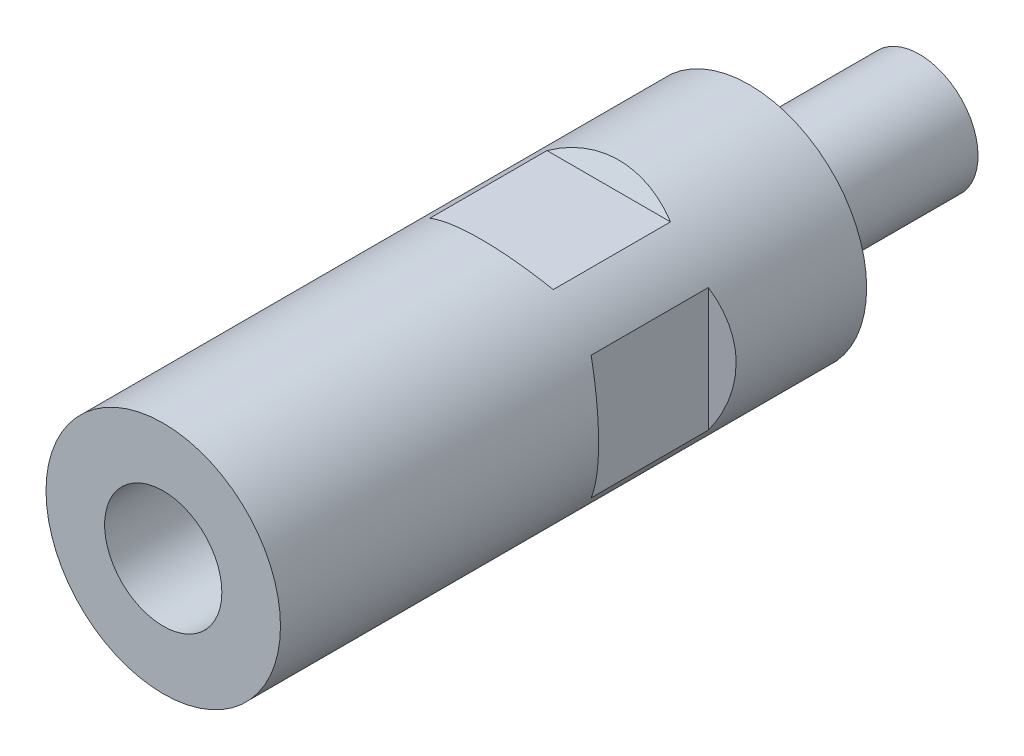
ISO-10303-21;
HEADER;
FILE_DESCRIPTION(('STEP AP214'),'2;1');
FILE_NAME('part.step','',(''),(''),'','','');
FILE_SCHEMA(('AUTOMOTIVE_DESIGN { 1 0 10303 214 1 1 1 1 }'));
ENDSEC;
DATA;
#1=APPLICATION_CONTEXT('core data for automotive mechanical design processes');
#2=APPLICATION_PROTOCOL_DEFINITION('international standard','automotive_design',2000,#1);
#3=PRODUCT_CONTEXT('',#1,'mechanical');
#4=PRODUCT('Part','Part','',(#3));
#5=PRODUCT_RELATED_PRODUCT_CATEGORY('part','',(#4));
#6=PRODUCT_DEFINITION_FORMATION('','',#4);
#7=PRODUCT_DEFINITION_CONTEXT('part definition',#1,'design');
#8=PRODUCT_DEFINITION('design','',#6,#7);
#9=PRODUCT_DEFINITION_SHAPE('','',#8);
#10=(LENGTH_UNIT() NAMED_UNIT(*) SI_UNIT(.MILLI.,.METRE.));
#11=(NAMED_UNIT(*) PLANE_ANGLE_UNIT() SI_UNIT($,.RADIAN.));
#12=(NAMED_UNIT(*) SI_UNIT($,.STERADIAN.) SOLID_ANGLE_UNIT());
#13=UNCERTAINTY_MEASURE_WITH_UNIT(LENGTH_MEASURE(1.E-05),#10,'distance_accuracy_value','');
#14=(GEOMETRIC_REPRESENTATION_CONTEXT(3) GLOBAL_UNCERTAINTY_ASSIGNED_CONTEXT((#13)) GLOBAL_UNIT_ASSIGNED_CONTEXT((#10,
#11,#12)) REPRESENTATION_CONTEXT('',''));
#15=CARTESIAN_POINT('',(0.,0.,0.));
#16=DIRECTION('',(0.,0.,1.));
#17=DIRECTION('',(1.,0.,0.));
#18=AXIS2_PLACEMENT_3D('',#15,#16,#17);
#19=CARTESIAN_POINT('',(0.,0.,-14.5));
#20=DIRECTION('',(0.,0.,1.));
#21=DIRECTION('',(0.,-1.,0.));
#22=AXIS2_PLACEMENT_3D('',#19,#20,#21);
#23=PLANE('',#22);
#24=CARTESIAN_POINT('',(0.,0.,-14.5));
#25=DIRECTION('',(0.,0.,1.));
#26=DIRECTION('',(0.,-1.,0.));
#27=AXIS2_PLACEMENT_3D('',#24,#25,#26);
#28=CIRCLE('',#27,5.);
#29=CARTESIAN_POINT('',(0.,-5.,-14.5));
#30=VERTEX_POINT('',#29);
#31=EDGE_CURVE('E21',#30,#30,#28,.F.);
#32=ORIENTED_EDGE('',*,*,#31,.T.);
#33=EDGE_LOOP('',(#32));
#34=FACE_BOUND('',#33,.T.);
#35=ADVANCED_FACE('F14',(#34),#23,.F.);
#36=CARTESIAN_POINT('',(0.,0.,5.5));
#37=DIRECTION('',(0.,0.,1.));
#38=DIRECTION('',(0.,-1.,0.));
#39=AXIS2_PLACEMENT_3D('',#36,#37,#38);
#40=CYLINDRICAL_SURFACE('',#39,5.);
#41=ORIENTED_EDGE('',*,*,#31,.F.);
#42=EDGE_LOOP('',(#41));
#43=FACE_BOUND('',#42,.T.);
#44=CARTESIAN_POINT('',(0.,0.,0.));
#45=DIRECTION('',(0.,0.,1.));
#46=DIRECTION('',(1.,0.,0.));
#47=AXIS2_PLACEMENT_3D('',#44,#45,#46);
#48=CIRCLE('',#47,5.);
#49=CARTESIAN_POINT('',(5.,0.,0.));
#50=VERTEX_POINT('',#49);
#51=EDGE_CURVE('E9',#50,#50,#48,.T.);
#52=ORIENTED_EDGE('',*,*,#51,.F.);
#53=EDGE_LOOP('',(#52));
#54=FACE_BOUND('',#53,.T.);
#55=ADVANCED_FACE('F108',(#43,#54),#40,.T.);
#56=CARTESIAN_POINT('',(0.,0.,50.));
#57=DIRECTION('',(0.,0.,1.));
#58=DIRECTION('',(1.,0.,0.));
#59=AXIS2_PLACEMENT_3D('',#56,#57,#58);
#60=PLANE('',#59);
#61=CARTESIAN_POINT('',(0.,4.36432032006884E-13,50.));
#62=DIRECTION('',(0.,0.,1.));
#63=DIRECTION('',(1.,0.,0.));
#64=AXIS2_PLACEMENT_3D('',#61,#62,#63);
#65=CIRCLE('',#64,5.);
#66=CARTESIAN_POINT('',(5.,4.36432032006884E-13,50.));
#67=VERTEX_POINT('',#66);
#68=EDGE_CURVE('E141',#67,#67,#65,.T.);
#69=ORIENTED_EDGE('',*,*,#68,.F.);
#70=EDGE_LOOP('',(#69));
#71=FACE_BOUND('',#70,.T.);
#72=CARTESIAN_POINT('',(0.,0.,50.));
#73=DIRECTION('',(0.,0.,1.));
#74=DIRECTION('',(1.,0.,0.));
#75=AXIS2_PLACEMENT_3D('',#72,#73,#74);
#76=CIRCLE('',#75,10.);
#77=CARTESIAN_POINT('',(10.,0.,50.));
#78=VERTEX_POINT('',#77);
#79=EDGE_CURVE('E144',#78,#78,#76,.T.);
#80=ORIENTED_EDGE('',*,*,#79,.T.);
#81=EDGE_LOOP('',(#80));
#82=FACE_BOUND('',#81,.T.);
#83=ADVANCED_FACE('F111',(#71,#82),#60,.T.);
#84=CARTESIAN_POINT('',(8.5,-10.,22.));
#85=DIRECTION('',(-0.5,0.,0.866025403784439));
#86=DIRECTION('',(0.866025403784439,0.,0.5));
#87=AXIS2_PLACEMENT_3D('',#84,#85,#86);
#88=PLANE('',#87);
#89=DIRECTION('',(0.,1.,0.));
#90=VECTOR('',#89,1.);
#91=CARTESIAN_POINT('',(8.5,-10.,22.));
#92=LINE('',#91,#90);
#93=CARTESIAN_POINT('',(8.5,-5.26782687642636,22.));
#94=VERTEX_POINT('',#93);
#95=CARTESIAN_POINT('',(8.5,5.26782687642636,22.));
#96=VERTEX_POINT('',#95);
#97=EDGE_CURVE('E151',#94,#96,#92,.T.);
#98=ORIENTED_EDGE('',*,*,#97,.T.);
#99=CARTESIAN_POINT('',(0.,0.,17.0925227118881));
#100=DIRECTION('',(-0.5,0.,0.866025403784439));
#101=DIRECTION('',(-0.866025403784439,0.,-0.5));
#102=AXIS2_PLACEMENT_3D('',#99,#100,#101);
#103=ELLIPSE('',#102,11.5470053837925,10.);
#104=EDGE_CURVE('E34',#94,#96,#103,.T.);
#105=ORIENTED_EDGE('',*,*,#104,.F.);
#106=EDGE_LOOP('',(#98,#105));
#107=FACE_BOUND('',#106,.T.);
#108=ADVANCED_FACE('F132',(#107),#88,.F.);
#109=CARTESIAN_POINT('',(8.5,-10.,22.));
#110=DIRECTION('',(-1.,0.,0.));
#111=DIRECTION('',(0.,0.,1.));
#112=AXIS2_PLACEMENT_3D('',#109,#110,#111);
#113=PLANE('',#112);
#114=ORIENTED_EDGE('',*,*,#97,.F.);
#115=DIRECTION('',(0.,0.,-1.));
#116=VECTOR('',#115,1.);
#117=CARTESIAN_POINT('',(8.5,-5.26782687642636,50.));
#118=LINE('',#117,#116);
#119=CARTESIAN_POINT('',(8.5,-5.26782687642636,12.));
#120=VERTEX_POINT('',#119);
#121=EDGE_CURVE('E157',#120,#94,#118,.F.);
#122=ORIENTED_EDGE('',*,*,#121,.F.);
#123=DIRECTION('',(0.,1.,0.));
#124=VECTOR('',#123,1.);
#125=CARTESIAN_POINT('',(8.5,-10.,12.));
#126=LINE('',#125,#124);
#127=CARTESIAN_POINT('',(8.5,5.26782687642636,12.));
#128=VERTEX_POINT('',#127);
#129=EDGE_CURVE('E200',#120,#128,#126,.T.);
#130=ORIENTED_EDGE('',*,*,#129,.T.);
#131=DIRECTION('',(0.,0.,-1.));
#132=VECTOR('',#131,1.);
#133=CARTESIAN_POINT('',(8.5,5.26782687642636,50.));
#134=LINE('',#133,#132);
#135=EDGE_CURVE('E28',#96,#128,#134,.T.);
#136=ORIENTED_EDGE('',*,*,#135,.F.);
#137=EDGE_LOOP('',(#114,#122,#130,#136));
#138=FACE_BOUND('',#137,.T.);
#139=ADVANCED_FACE('F137',(#138),#113,.F.);
#140=CARTESIAN_POINT('',(8.5,-10.,12.));
#141=DIRECTION('',(-0.5,0.,-0.866025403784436));
#142=DIRECTION('',(-0.866025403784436,0.,0.5));
#143=AXIS2_PLACEMENT_3D('',#140,#141,#142);
#144=PLANE('',#143);
#145=CARTESIAN_POINT('',(0.,0.,16.9074772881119));
#146=DIRECTION('',(-0.5,0.,-0.866025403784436));
#147=DIRECTION('',(0.866025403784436,0.,-0.5));
#148=AXIS2_PLACEMENT_3D('',#145,#146,#147);
#149=ELLIPSE('',#148,11.5470053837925,10.);
#150=EDGE_CURVE('E146',#128,#120,#149,.T.);
#151=ORIENTED_EDGE('',*,*,#150,.F.);
#152=ORIENTED_EDGE('',*,*,#129,.F.);
#153=EDGE_LOOP('',(#151,#152));
#154=FACE_BOUND('',#153,.T.);
#155=ADVANCED_FACE('F207',(#154),#144,.F.);
#156=CARTESIAN_POINT('',(-8.5,-10.,12.));
#157=DIRECTION('',(0.5,0.,-0.866025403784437));
#158=DIRECTION('',(-0.866025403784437,0.,-0.5));
#159=AXIS2_PLACEMENT_3D('',#156,#157,#158);
#160=PLANE('',#159);
#161=CARTESIAN_POINT('',(0.,0.,16.9074772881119));
#162=DIRECTION('',(0.5,0.,-0.866025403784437));
#163=DIRECTION('',(-0.866025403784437,0.,-0.5));
#164=AXIS2_PLACEMENT_3D('',#161,#162,#163);
#165=ELLIPSE('',#164,11.5470053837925,10.);
#166=CARTESIAN_POINT('',(-8.5,-5.26782687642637,12.));
#167=VERTEX_POINT('',#166);
#168=CARTESIAN_POINT('',(-8.5,5.26782687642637,12.));
#169=VERTEX_POINT('',#168);
#170=EDGE_CURVE('E160',#167,#169,#165,.T.);
#171=ORIENTED_EDGE('',*,*,#170,.F.);
#172=DIRECTION('',(0.,1.,0.));
#173=VECTOR('',#172,1.);
#174=CARTESIAN_POINT('',(-8.5,-10.,12.));
#175=LINE('',#174,#173);
#176=EDGE_CURVE('E193',#167,#169,#175,.T.);
#177=ORIENTED_EDGE('',*,*,#176,.T.);
#178=EDGE_LOOP('',(#171,#177));
#179=FACE_BOUND('',#178,.T.);
#180=ADVANCED_FACE('F209',(#179),#160,.F.);
#181=CARTESIAN_POINT('',(-8.5,-10.,22.));
#182=DIRECTION('',(0.5,0.,0.866025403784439));
#183=DIRECTION('',(0.866025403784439,0.,-0.5));
#184=AXIS2_PLACEMENT_3D('',#181,#182,#183);
#185=PLANE('',#184);
#186=DIRECTION('',(0.,1.,0.));
#187=VECTOR('',#186,1.);
#188=CARTESIAN_POINT('',(-8.5,-10.,22.));
#189=LINE('',#188,#187);
#190=CARTESIAN_POINT('',(-8.5,-5.26782687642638,22.));
#191=VERTEX_POINT('',#190);
#192=CARTESIAN_POINT('',(-8.5,5.26782687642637,22.));
#193=VERTEX_POINT('',#192);
#194=EDGE_CURVE('E197',#191,#193,#189,.T.);
#195=ORIENTED_EDGE('',*,*,#194,.F.);
#196=CARTESIAN_POINT('',(0.,0.,17.0925227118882));
#197=DIRECTION('',(0.5,0.,0.866025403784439));
#198=DIRECTION('',(0.866025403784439,0.,-0.5));
#199=AXIS2_PLACEMENT_3D('',#196,#197,#198);
#200=ELLIPSE('',#199,11.5470053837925,10.);
#201=EDGE_CURVE('E168',#193,#191,#200,.T.);
#202=ORIENTED_EDGE('',*,*,#201,.F.);
#203=EDGE_LOOP('',(#195,#202));
#204=FACE_BOUND('',#203,.T.);
#205=ADVANCED_FACE('F215',(#204),#185,.F.);
#206=CARTESIAN_POINT('',(-8.5,-10.,22.));
#207=DIRECTION('',(1.,0.,0.));
#208=DIRECTION('',(0.,0.,-1.));
#209=AXIS2_PLACEMENT_3D('',#206,#207,#208);
#210=PLANE('',#209);
#211=ORIENTED_EDGE('',*,*,#194,.T.);
#212=DIRECTION('',(0.,0.,-1.));
#213=VECTOR('',#212,1.);
#214=CARTESIAN_POINT('',(-8.5,5.26782687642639,50.));
#215=LINE('',#214,#213);
#216=EDGE_CURVE('E162',#169,#193,#215,.F.);
#217=ORIENTED_EDGE('',*,*,#216,.F.);
#218=ORIENTED_EDGE('',*,*,#176,.F.);
#219=DIRECTION('',(0.,0.,-1.));
#220=VECTOR('',#219,1.);
#221=CARTESIAN_POINT('',(-8.5,-5.26782687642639,50.));
#222=LINE('',#221,#220);
#223=EDGE_CURVE('E165',#191,#167,#222,.T.);
#224=ORIENTED_EDGE('',*,*,#223,.F.);
#225=EDGE_LOOP('',(#211,#217,#218,#224));
#226=FACE_BOUND('',#225,.T.);
#227=ADVANCED_FACE('F220',(#226),#210,.F.);
#228=CARTESIAN_POINT('',(10.,8.5,22.));
#229=DIRECTION('',(0.,-0.5,0.866025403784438));
#230=DIRECTION('',(0.,-0.866025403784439,-0.5));
#231=AXIS2_PLACEMENT_3D('',#228,#229,#230);
#232=PLANE('',#231);
#233=DIRECTION('',(-1.,0.,0.));
#234=VECTOR('',#233,1.);
#235=CARTESIAN_POINT('',(10.,8.5,22.));
#236=LINE('',#235,#234);
#237=CARTESIAN_POINT('',(5.26782687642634,8.5,22.));
#238=VERTEX_POINT('',#237);
#239=CARTESIAN_POINT('',(-5.26782687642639,8.5,22.));
#240=VERTEX_POINT('',#239);
#241=EDGE_CURVE('E189',#238,#240,#236,.T.);
#242=ORIENTED_EDGE('',*,*,#241,.T.);
#243=CARTESIAN_POINT('',(0.,0.,17.0925227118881));
#244=DIRECTION('',(0.,-0.5,0.866025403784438));
#245=DIRECTION('',(0.,-0.866025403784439,-0.5));
#246=AXIS2_PLACEMENT_3D('',#243,#244,#245);
#247=ELLIPSE('',#246,11.5470053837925,10.);
#248=EDGE_CURVE('E176',#238,#240,#247,.T.);
#249=ORIENTED_EDGE('',*,*,#248,.F.);
#250=EDGE_LOOP('',(#242,#249));
#251=FACE_BOUND('',#250,.T.);
#252=ADVANCED_FACE('F222',(#251),#232,.F.);
#253=CARTESIAN_POINT('',(10.,8.5,22.));
#254=DIRECTION('',(0.,-1.,0.));
#255=DIRECTION('',(1.,0.,0.));
#256=AXIS2_PLACEMENT_3D('',#253,#254,#255);
#257=PLANE('',#256);
#258=ORIENTED_EDGE('',*,*,#241,.F.);
#259=DIRECTION('',(0.,0.,-1.));
#260=VECTOR('',#259,1.);
#261=CARTESIAN_POINT('',(5.26782687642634,8.5,50.));
#262=LINE('',#261,#260);
#263=CARTESIAN_POINT('',(5.26782687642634,8.5,12.));
#264=VERTEX_POINT('',#263);
#265=EDGE_CURVE('E87',#264,#238,#262,.F.);
#266=ORIENTED_EDGE('',*,*,#265,.F.);
#267=DIRECTION('',(-1.,0.,0.));
#268=VECTOR('',#267,1.);
#269=CARTESIAN_POINT('',(10.,8.5,12.));
#270=LINE('',#269,#268);
#271=CARTESIAN_POINT('',(-5.26782687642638,8.5,12.));
#272=VERTEX_POINT('',#271);
#273=EDGE_CURVE('E187',#264,#272,#270,.T.);
#274=ORIENTED_EDGE('',*,*,#273,.T.);
#275=DIRECTION('',(0.,0.,-1.));
#276=VECTOR('',#275,1.);
#277=CARTESIAN_POINT('',(-5.2678268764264,8.5,50.));
#278=LINE('',#277,#276);
#279=EDGE_CURVE('E173',#240,#272,#278,.T.);
#280=ORIENTED_EDGE('',*,*,#279,.F.);
#281=EDGE_LOOP('',(#258,#266,#274,#280));
#282=FACE_BOUND('',#281,.T.);
#283=ADVANCED_FACE('F186',(#282),#257,.F.);
#284=CARTESIAN_POINT('',(10.,8.5,12.));
#285=DIRECTION('',(0.,-0.5,-0.866025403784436));
#286=DIRECTION('',(0.,0.866025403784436,-0.5));
#287=AXIS2_PLACEMENT_3D('',#284,#285,#286);
#288=PLANE('',#287);
#289=CARTESIAN_POINT('',(0.,0.,16.9074772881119));
#290=DIRECTION('',(0.,-0.5,-0.866025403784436));
#291=DIRECTION('',(0.,0.866025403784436,-0.5));
#292=AXIS2_PLACEMENT_3D('',#289,#290,#291);
#293=ELLIPSE('',#292,11.5470053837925,10.);
#294=EDGE_CURVE('E171',#272,#264,#293,.T.);
#295=ORIENTED_EDGE('',*,*,#294,.F.);
#296=ORIENTED_EDGE('',*,*,#273,.F.);
#297=EDGE_LOOP('',(#295,#296));
#298=FACE_BOUND('',#297,.T.);
#299=ADVANCED_FACE('F191',(#298),#288,.F.);
#300=CARTESIAN_POINT('',(10.,-8.5,12.));
#301=DIRECTION('',(0.,0.5,-0.866025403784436));
#302=DIRECTION('',(0.,0.866025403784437,0.5));
#303=AXIS2_PLACEMENT_3D('',#300,#301,#302);
#304=PLANE('',#303);
#305=CARTESIAN_POINT('',(0.,0.,16.9074772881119));
#306=DIRECTION('',(0.,0.5,-0.866025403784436));
#307=DIRECTION('',(0.,-0.866025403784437,-0.5));
#308=AXIS2_PLACEMENT_3D('',#305,#306,#307);
#309=ELLIPSE('',#308,11.5470053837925,10.);
#310=CARTESIAN_POINT('',(5.26782687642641,-8.5,12.));
#311=VERTEX_POINT('',#310);
#312=CARTESIAN_POINT('',(-5.26782687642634,-8.5,12.));
#313=VERTEX_POINT('',#312);
#314=EDGE_CURVE('E78',#311,#313,#309,.T.);
#315=ORIENTED_EDGE('',*,*,#314,.F.);
#316=DIRECTION('',(-1.,0.,0.));
#317=VECTOR('',#316,1.);
#318=CARTESIAN_POINT('',(10.,-8.5,12.));
#319=LINE('',#318,#317);
#320=EDGE_CURVE('E81',#311,#313,#319,.T.);
#321=ORIENTED_EDGE('',*,*,#320,.T.);
#322=EDGE_LOOP('',(#315,#321));
#323=FACE_BOUND('',#322,.T.);
#324=ADVANCED_FACE('F80',(#323),#304,.F.);
#325=CARTESIAN_POINT('',(10.,-8.5,22.));
#326=DIRECTION('',(0.,0.5,0.866025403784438));
#327=DIRECTION('',(0.,-0.866025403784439,0.5));
#328=AXIS2_PLACEMENT_3D('',#325,#326,#327);
#329=PLANE('',#328);
#330=DIRECTION('',(-1.,0.,0.));
#331=VECTOR('',#330,1.);
#332=CARTESIAN_POINT('',(10.,-8.5,22.));
#333=LINE('',#332,#331);
#334=CARTESIAN_POINT('',(5.26782687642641,-8.5,22.));
#335=VERTEX_POINT('',#334);
#336=CARTESIAN_POINT('',(-5.26782687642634,-8.5,22.));
#337=VERTEX_POINT('',#336);
#338=EDGE_CURVE('E94',#335,#337,#333,.T.);
#339=ORIENTED_EDGE('',*,*,#338,.F.);
#340=CARTESIAN_POINT('',(0.,0.,17.0925227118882));
#341=DIRECTION('',(0.,0.5,0.866025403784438));
#342=DIRECTION('',(0.,0.866025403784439,-0.5));
#343=AXIS2_PLACEMENT_3D('',#340,#341,#342);
#344=ELLIPSE('',#343,11.5470053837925,10.);
#345=EDGE_CURVE('E100',#337,#335,#344,.T.);
#346=ORIENTED_EDGE('',*,*,#345,.F.);
#347=EDGE_LOOP('',(#339,#346));
#348=FACE_BOUND('',#347,.T.);
#349=ADVANCED_FACE('F237',(#348),#329,.F.);
#350=CARTESIAN_POINT('',(10.,-8.5,22.));
#351=DIRECTION('',(0.,1.,0.));
#352=DIRECTION('',(-1.,0.,0.));
#353=AXIS2_PLACEMENT_3D('',#350,#351,#352);
#354=PLANE('',#353);
#355=ORIENTED_EDGE('',*,*,#338,.T.);
#356=DIRECTION('',(0.,0.,-1.));
#357=VECTOR('',#356,1.);
#358=CARTESIAN_POINT('',(-5.26782687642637,-8.5,50.));
#359=LINE('',#358,#357);
#360=EDGE_CURVE('E86',#313,#337,#359,.F.);
#361=ORIENTED_EDGE('',*,*,#360,.F.);
#362=ORIENTED_EDGE('',*,*,#320,.F.);
#363=DIRECTION('',(0.,0.,-1.));
#364=VECTOR('',#363,1.);
#365=CARTESIAN_POINT('',(5.26782687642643,-8.5,50.));
#366=LINE('',#365,#364);
#367=EDGE_CURVE('E92',#335,#311,#366,.T.);
#368=ORIENTED_EDGE('',*,*,#367,.F.);
#369=EDGE_LOOP('',(#355,#361,#362,#368));
#370=FACE_BOUND('',#369,.T.);
#371=ADVANCED_FACE('F91',(#370),#354,.F.);
#372=CARTESIAN_POINT('',(0.,0.,50.));
#373=DIRECTION('',(0.,0.,-1.));
#374=DIRECTION('',(-1.,0.,0.));
#375=AXIS2_PLACEMENT_3D('',#372,#373,#374);
#376=CYLINDRICAL_SURFACE('',#375,10.);
#377=ORIENTED_EDGE('',*,*,#360,.T.);
#378=ORIENTED_EDGE('',*,*,#345,.T.);
#379=ORIENTED_EDGE('',*,*,#367,.T.);
#380=ORIENTED_EDGE('',*,*,#314,.T.);
#381=EDGE_LOOP('',(#377,#378,#379,#380));
#382=FACE_BOUND('',#381,.T.);
#383=ORIENTED_EDGE('',*,*,#294,.T.);
#384=ORIENTED_EDGE('',*,*,#265,.T.);
#385=ORIENTED_EDGE('',*,*,#248,.T.);
#386=ORIENTED_EDGE('',*,*,#279,.T.);
#387=EDGE_LOOP('',(#383,#384,#385,#386));
#388=FACE_BOUND('',#387,.T.);
#389=ORIENTED_EDGE('',*,*,#216,.T.);
#390=ORIENTED_EDGE('',*,*,#201,.T.);
#391=ORIENTED_EDGE('',*,*,#223,.T.);
#392=ORIENTED_EDGE('',*,*,#170,.T.);
#393=EDGE_LOOP('',(#389,#390,#391,#392));
#394=FACE_BOUND('',#393,.T.);
#395=ORIENTED_EDGE('',*,*,#150,.T.);
#396=ORIENTED_EDGE('',*,*,#121,.T.);
#397=ORIENTED_EDGE('',*,*,#104,.T.);
#398=ORIENTED_EDGE('',*,*,#135,.T.);
#399=EDGE_LOOP('',(#395,#396,#397,#398));
#400=FACE_BOUND('',#399,.T.);
#401=ORIENTED_EDGE('',*,*,#79,.F.);
#402=EDGE_LOOP('',(#401));
#403=FACE_BOUND('',#402,.T.);
#404=CARTESIAN_POINT('',(0.,0.,0.));
#405=DIRECTION('',(0.,0.,1.));
#406=DIRECTION('',(1.,0.,0.));
#407=AXIS2_PLACEMENT_3D('',#404,#405,#406);
#408=CIRCLE('',#407,10.);
#409=CARTESIAN_POINT('',(10.,0.,0.));
#410=VERTEX_POINT('',#409);
#411=EDGE_CURVE('E147',#410,#410,#408,.T.);
#412=ORIENTED_EDGE('',*,*,#411,.T.);
#413=EDGE_LOOP('',(#412));
#414=FACE_BOUND('',#413,.T.);
#415=ADVANCED_FACE('F98',(#382,#388,#394,#400,#403,#414),#376,.T.);
#416=CARTESIAN_POINT('',(0.,0.,0.));
#417=DIRECTION('',(0.,0.,1.));
#418=DIRECTION('',(1.,0.,0.));
#419=AXIS2_PLACEMENT_3D('',#416,#417,#418);
#420=PLANE('',#419);
#421=ORIENTED_EDGE('',*,*,#411,.F.);
#422=EDGE_LOOP('',(#421));
#423=FACE_BOUND('',#422,.T.);
#424=ORIENTED_EDGE('',*,*,#51,.T.);
#425=EDGE_LOOP('',(#424));
#426=FACE_BOUND('',#425,.T.);
#427=ADVANCED_FACE('F114',(#423,#426),#420,.F.);
#428=CARTESIAN_POINT('',(0.,4.36432032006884E-13,50.));
#429=DIRECTION('',(0.,0.,1.));
#430=DIRECTION('',(1.,0.,0.));
#431=AXIS2_PLACEMENT_3D('',#428,#429,#430);
#432=CYLINDRICAL_SURFACE('',#431,5.);
#433=CARTESIAN_POINT('',(0.,4.36432032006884E-13,25.));
#434=DIRECTION('',(0.,0.,1.));
#435=DIRECTION('',(1.,0.,0.));
#436=AXIS2_PLACEMENT_3D('',#433,#434,#435);
#437=CIRCLE('',#436,5.);
#438=CARTESIAN_POINT('',(5.,4.36432032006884E-13,25.));
#439=VERTEX_POINT('',#438);
#440=EDGE_CURVE('E95',#439,#439,#437,.T.);
#441=ORIENTED_EDGE('',*,*,#440,.F.);
#442=EDGE_LOOP('',(#441));
#443=FACE_BOUND('',#442,.T.);
#444=ORIENTED_EDGE('',*,*,#68,.T.);
#445=EDGE_LOOP('',(#444));
#446=FACE_BOUND('',#445,.T.);
#447=ADVANCED_FACE('F116',(#443,#446),#432,.F.);
#448=CARTESIAN_POINT('',(5.,4.36432032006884E-13,25.));
#449=DIRECTION('',(0.,0.,-1.));
#450=DIRECTION('',(-1.,0.,0.));
#451=AXIS2_PLACEMENT_3D('',#448,#449,#450);
#452=PLANE('',#451);
#453=ORIENTED_EDGE('',*,*,#440,.T.);
#454=EDGE_LOOP('',(#453));
#455=FACE_BOUND('',#454,.T.);
#456=ADVANCED_FACE('F124',(#455),#452,.F.);
#457=CLOSED_SHELL('',(#35,#55,#83,#108,#139,#155,#180,#205,#227,#252,#283,#299,#324,#349,#371,
#415,#427,#447,#456));
#458=MANIFOLD_SOLID_BREP('B1',#457);
#459=ADVANCED_BREP_SHAPE_REPRESENTATION('',(#18,#458),#14);
#460=SHAPE_DEFINITION_REPRESENTATION(#9,#459);
ENDSEC;
END-ISO-10303-21;
